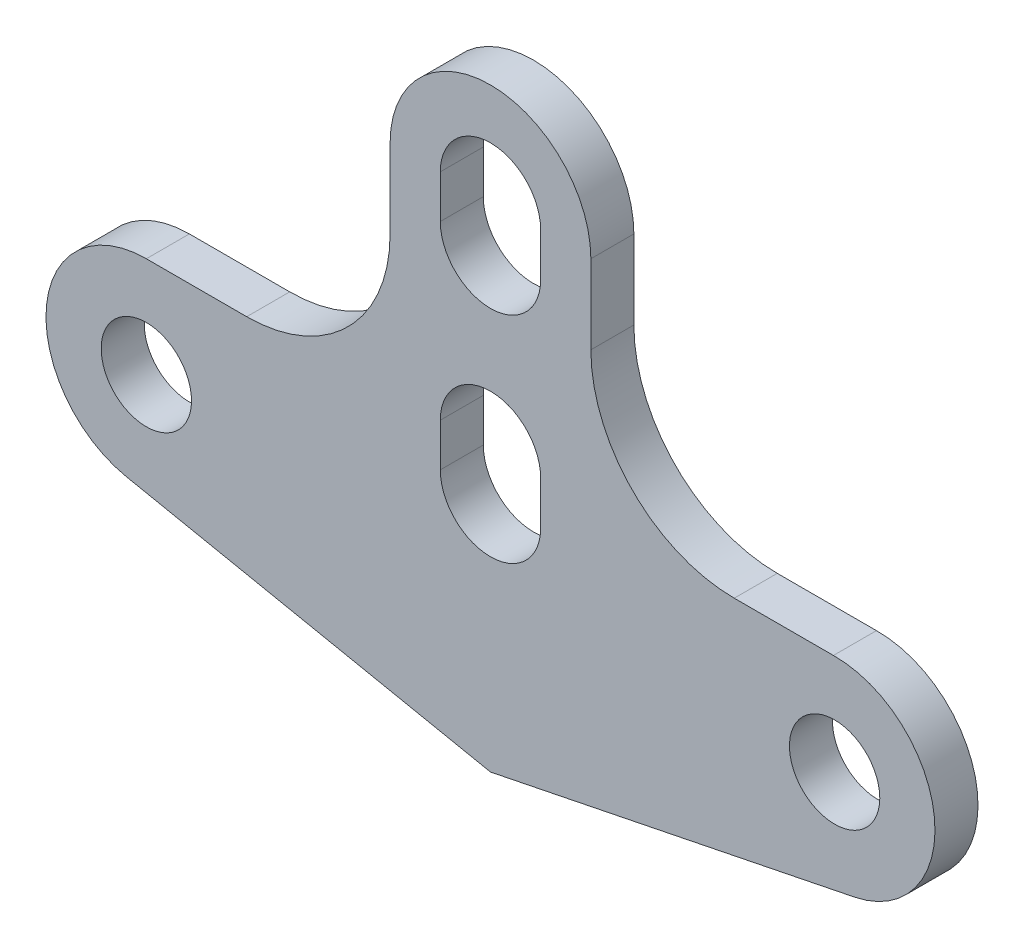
ISO-10303-21;
HEADER;
FILE_DESCRIPTION(('STEP AP214'),'2;1');
FILE_NAME('part.step','',(''),(''),'','','');
FILE_SCHEMA(('AUTOMOTIVE_DESIGN { 1 0 10303 214 1 1 1 1 }'));
ENDSEC;
DATA;
#1=APPLICATION_CONTEXT('core data for automotive mechanical design processes');
#2=APPLICATION_PROTOCOL_DEFINITION('international standard','automotive_design',2000,#1);
#3=PRODUCT_CONTEXT('',#1,'mechanical');
#4=PRODUCT('Part','Part','',(#3));
#5=PRODUCT_RELATED_PRODUCT_CATEGORY('part','',(#4));
#6=PRODUCT_DEFINITION_FORMATION('','',#4);
#7=PRODUCT_DEFINITION_CONTEXT('part definition',#1,'design');
#8=PRODUCT_DEFINITION('design','',#6,#7);
#9=PRODUCT_DEFINITION_SHAPE('','',#8);
#10=(LENGTH_UNIT() NAMED_UNIT(*) SI_UNIT(.MILLI.,.METRE.));
#11=(NAMED_UNIT(*) PLANE_ANGLE_UNIT() SI_UNIT($,.RADIAN.));
#12=(NAMED_UNIT(*) SI_UNIT($,.STERADIAN.) SOLID_ANGLE_UNIT());
#13=UNCERTAINTY_MEASURE_WITH_UNIT(LENGTH_MEASURE(1.E-05),#10,'distance_accuracy_value','');
#14=(GEOMETRIC_REPRESENTATION_CONTEXT(3) GLOBAL_UNCERTAINTY_ASSIGNED_CONTEXT((#13)) GLOBAL_UNIT_ASSIGNED_CONTEXT((#10,
#11,#12)) REPRESENTATION_CONTEXT('',''));
#15=CARTESIAN_POINT('',(0.,0.,0.));
#16=DIRECTION('',(0.,0.,1.));
#17=DIRECTION('',(1.,0.,0.));
#18=AXIS2_PLACEMENT_3D('',#15,#16,#17);
#19=CARTESIAN_POINT('',(24.,-22.5,3.));
#20=DIRECTION('',(0.,0.,1.));
#21=DIRECTION('',(1.,0.,0.));
#22=AXIS2_PLACEMENT_3D('',#19,#20,#21);
#23=PLANE('',#22);
#24=CARTESIAN_POINT('',(24.,-22.5,3.));
#25=DIRECTION('',(0.,0.,1.));
#26=DIRECTION('',(1.,0.,0.));
#27=AXIS2_PLACEMENT_3D('',#24,#25,#26);
#28=CIRCLE('',#27,3.15);
#29=CARTESIAN_POINT('',(27.15,-22.5,3.));
#30=VERTEX_POINT('',#29);
#31=EDGE_CURVE('E200',#30,#30,#28,.T.);
#32=ORIENTED_EDGE('',*,*,#31,.F.);
#33=EDGE_LOOP('',(#32));
#34=FACE_BOUND('',#33,.T.);
#35=CARTESIAN_POINT('',(0.,0.,3.));
#36=DIRECTION('',(0.,0.,1.));
#37=DIRECTION('',(-1.,0.,0.));
#38=AXIS2_PLACEMENT_3D('',#35,#36,#37);
#39=CIRCLE('',#38,3.5);
#40=CARTESIAN_POINT('',(3.5,0.,3.));
#41=VERTEX_POINT('',#40);
#42=CARTESIAN_POINT('',(-3.5,0.,3.));
#43=VERTEX_POINT('',#42);
#44=EDGE_CURVE('E225',#41,#43,#39,.T.);
#45=ORIENTED_EDGE('',*,*,#44,.F.);
#46=DIRECTION('',(0.,1.,0.));
#47=VECTOR('',#46,1.);
#48=CARTESIAN_POINT('',(3.5,0.,3.));
#49=LINE('',#48,#47);
#50=CARTESIAN_POINT('',(3.5,-3.,3.));
#51=VERTEX_POINT('',#50);
#52=EDGE_CURVE('E223',#51,#41,#49,.T.);
#53=ORIENTED_EDGE('',*,*,#52,.F.);
#54=CARTESIAN_POINT('',(0.,-3.,3.));
#55=DIRECTION('',(0.,0.,1.));
#56=DIRECTION('',(-1.,0.,0.));
#57=AXIS2_PLACEMENT_3D('',#54,#55,#56);
#58=CIRCLE('',#57,3.5);
#59=CARTESIAN_POINT('',(-3.5,-3.,3.));
#60=VERTEX_POINT('',#59);
#61=EDGE_CURVE('E221',#60,#51,#58,.T.);
#62=ORIENTED_EDGE('',*,*,#61,.F.);
#63=DIRECTION('',(0.,-1.,0.));
#64=VECTOR('',#63,1.);
#65=CARTESIAN_POINT('',(-3.5,0.,3.));
#66=LINE('',#65,#64);
#67=EDGE_CURVE('E227',#43,#60,#66,.T.);
#68=ORIENTED_EDGE('',*,*,#67,.F.);
#69=EDGE_LOOP('',(#45,#53,#62,#68));
#70=FACE_BOUND('',#69,.T.);
#71=CARTESIAN_POINT('',(24.,-22.5,3.));
#72=DIRECTION('',(0.,0.,1.));
#73=DIRECTION('',(1.,0.,0.));
#74=AXIS2_PLACEMENT_3D('',#71,#72,#73);
#75=CIRCLE('',#74,7.);
#76=CARTESIAN_POINT('',(25.388761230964,-29.3608557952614,3.));
#77=VERTEX_POINT('',#76);
#78=CARTESIAN_POINT('',(23.9169919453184,-15.500492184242,3.));
#79=VERTEX_POINT('',#78);
#80=EDGE_CURVE('E264',#77,#79,#75,.T.);
#81=ORIENTED_EDGE('',*,*,#80,.T.);
#82=DIRECTION('',(-1.,0.,0.));
#83=VECTOR('',#82,1.);
#84=CARTESIAN_POINT('',(17.,-15.500492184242,3.));
#85=LINE('',#84,#83);
#86=CARTESIAN_POINT('',(17.,-15.500492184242,3.));
#87=VERTEX_POINT('',#86);
#88=EDGE_CURVE('E267',#79,#87,#85,.T.);
#89=ORIENTED_EDGE('',*,*,#88,.T.);
#90=CARTESIAN_POINT('',(17.,-5.50049218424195,3.));
#91=DIRECTION('',(0.,0.,-1.));
#92=DIRECTION('',(1.,0.,0.));
#93=AXIS2_PLACEMENT_3D('',#90,#91,#92);
#94=CIRCLE('',#93,10.);
#95=CARTESIAN_POINT('',(7.,-5.50049218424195,3.));
#96=VERTEX_POINT('',#95);
#97=EDGE_CURVE('E269',#87,#96,#94,.T.);
#98=ORIENTED_EDGE('',*,*,#97,.T.);
#99=DIRECTION('',(0.,1.,0.));
#100=VECTOR('',#99,1.);
#101=CARTESIAN_POINT('',(7.,0.,3.));
#102=LINE('',#101,#100);
#103=CARTESIAN_POINT('',(7.,0.,3.));
#104=VERTEX_POINT('',#103);
#105=EDGE_CURVE('E271',#96,#104,#102,.T.);
#106=ORIENTED_EDGE('',*,*,#105,.T.);
#107=CARTESIAN_POINT('',(0.,0.,3.));
#108=DIRECTION('',(0.,0.,1.));
#109=DIRECTION('',(1.,0.,0.));
#110=AXIS2_PLACEMENT_3D('',#107,#108,#109);
#111=CIRCLE('',#110,7.);
#112=CARTESIAN_POINT('',(-7.,0.,3.));
#113=VERTEX_POINT('',#112);
#114=EDGE_CURVE('E273',#104,#113,#111,.T.);
#115=ORIENTED_EDGE('',*,*,#114,.T.);
#116=DIRECTION('',(0.,-1.,0.));
#117=VECTOR('',#116,1.);
#118=CARTESIAN_POINT('',(-7.,0.,3.));
#119=LINE('',#118,#117);
#120=CARTESIAN_POINT('',(-7.,-5.5,3.));
#121=VERTEX_POINT('',#120);
#122=EDGE_CURVE('E275',#113,#121,#119,.T.);
#123=ORIENTED_EDGE('',*,*,#122,.T.);
#124=CARTESIAN_POINT('',(-17.,-5.5,3.));
#125=DIRECTION('',(0.,0.,-1.));
#126=DIRECTION('',(1.,0.,0.));
#127=AXIS2_PLACEMENT_3D('',#124,#125,#126);
#128=CIRCLE('',#127,10.);
#129=CARTESIAN_POINT('',(-17.,-15.5,3.));
#130=VERTEX_POINT('',#129);
#131=EDGE_CURVE('E277',#121,#130,#128,.T.);
#132=ORIENTED_EDGE('',*,*,#131,.T.);
#133=DIRECTION('',(-1.,0.,0.));
#134=VECTOR('',#133,1.);
#135=CARTESIAN_POINT('',(-17.,-15.5,3.));
#136=LINE('',#135,#134);
#137=CARTESIAN_POINT('',(-24.,-15.5,3.));
#138=VERTEX_POINT('',#137);
#139=EDGE_CURVE('E279',#130,#138,#136,.T.);
#140=ORIENTED_EDGE('',*,*,#139,.T.);
#141=CARTESIAN_POINT('',(-24.,-22.5,3.));
#142=DIRECTION('',(0.,0.,1.));
#143=DIRECTION('',(1.,0.,0.));
#144=AXIS2_PLACEMENT_3D('',#141,#142,#143);
#145=CIRCLE('',#144,7.);
#146=CARTESIAN_POINT('',(-25.388761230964,-29.3608557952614,3.));
#147=VERTEX_POINT('',#146);
#148=EDGE_CURVE('E281',#138,#147,#145,.T.);
#149=ORIENTED_EDGE('',*,*,#148,.T.);
#150=DIRECTION('',(0.980122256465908,-0.198394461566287,0.));
#151=VECTOR('',#150,1.);
#152=CARTESIAN_POINT('',(-25.388761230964,-29.3608557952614,3.));
#153=LINE('',#152,#151);
#154=CARTESIAN_POINT('',(0.,-34.5,3.));
#155=VERTEX_POINT('',#154);
#156=EDGE_CURVE('E283',#147,#155,#153,.T.);
#157=ORIENTED_EDGE('',*,*,#156,.T.);
#158=DIRECTION('',(0.980122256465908,0.198394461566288,0.));
#159=VECTOR('',#158,1.);
#160=CARTESIAN_POINT('',(0.,-34.5,3.));
#161=LINE('',#160,#159);
#162=EDGE_CURVE('E285',#155,#77,#161,.T.);
#163=ORIENTED_EDGE('',*,*,#162,.T.);
#164=EDGE_LOOP('',(#81,#89,#98,#106,#115,#123,#132,#140,#149,#157,#163));
#165=FACE_BOUND('',#164,.T.);
#166=CARTESIAN_POINT('',(-24.,-22.5,3.));
#167=DIRECTION('',(0.,0.,1.));
#168=DIRECTION('',(1.,0.,0.));
#169=AXIS2_PLACEMENT_3D('',#166,#167,#168);
#170=CIRCLE('',#169,3.15);
#171=CARTESIAN_POINT('',(-20.85,-22.5,3.));
#172=VERTEX_POINT('',#171);
#173=EDGE_CURVE('E206',#172,#172,#170,.T.);
#174=ORIENTED_EDGE('',*,*,#173,.F.);
#175=EDGE_LOOP('',(#174));
#176=FACE_BOUND('',#175,.T.);
#177=DIRECTION('',(0.,-1.,0.));
#178=VECTOR('',#177,1.);
#179=CARTESIAN_POINT('',(-3.5,-15.,3.));
#180=LINE('',#179,#178);
#181=CARTESIAN_POINT('',(-3.5,-15.,3.));
#182=VERTEX_POINT('',#181);
#183=CARTESIAN_POINT('',(-3.5,-18.,3.));
#184=VERTEX_POINT('',#183);
#185=EDGE_CURVE('E188',#182,#184,#180,.T.);
#186=ORIENTED_EDGE('',*,*,#185,.F.);
#187=CARTESIAN_POINT('',(0.,-15.,3.));
#188=DIRECTION('',(0.,0.,1.));
#189=DIRECTION('',(-1.,0.,0.));
#190=AXIS2_PLACEMENT_3D('',#187,#188,#189);
#191=CIRCLE('',#190,3.5);
#192=CARTESIAN_POINT('',(3.5,-15.,3.));
#193=VERTEX_POINT('',#192);
#194=EDGE_CURVE('E177',#193,#182,#191,.T.);
#195=ORIENTED_EDGE('',*,*,#194,.F.);
#196=DIRECTION('',(0.,1.,0.));
#197=VECTOR('',#196,1.);
#198=CARTESIAN_POINT('',(3.5,-15.,3.));
#199=LINE('',#198,#197);
#200=CARTESIAN_POINT('',(3.5,-18.,3.));
#201=VERTEX_POINT('',#200);
#202=EDGE_CURVE('E192',#201,#193,#199,.T.);
#203=ORIENTED_EDGE('',*,*,#202,.F.);
#204=CARTESIAN_POINT('',(0.,-18.,3.));
#205=DIRECTION('',(0.,0.,1.));
#206=DIRECTION('',(1.,0.,0.));
#207=AXIS2_PLACEMENT_3D('',#204,#205,#206);
#208=CIRCLE('',#207,3.5);
#209=EDGE_CURVE('E190',#184,#201,#208,.T.);
#210=ORIENTED_EDGE('',*,*,#209,.F.);
#211=EDGE_LOOP('',(#186,#195,#203,#210));
#212=FACE_BOUND('',#211,.T.);
#213=ADVANCED_FACE('F31',(#34,#70,#165,#176,#212),#23,.T.);
#214=CARTESIAN_POINT('',(24.,-22.5,0.));
#215=DIRECTION('',(0.,0.,1.));
#216=DIRECTION('',(1.,0.,0.));
#217=AXIS2_PLACEMENT_3D('',#214,#215,#216);
#218=PLANE('',#217);
#219=CARTESIAN_POINT('',(24.,-22.5,0.));
#220=DIRECTION('',(0.,0.,1.));
#221=DIRECTION('',(1.,0.,0.));
#222=AXIS2_PLACEMENT_3D('',#219,#220,#221);
#223=CIRCLE('',#222,3.15);
#224=CARTESIAN_POINT('',(27.15,-22.5,0.));
#225=VERTEX_POINT('',#224);
#226=EDGE_CURVE('E178',#225,#225,#223,.T.);
#227=ORIENTED_EDGE('',*,*,#226,.T.);
#228=EDGE_LOOP('',(#227));
#229=FACE_BOUND('',#228,.T.);
#230=CARTESIAN_POINT('',(0.,-3.,0.));
#231=DIRECTION('',(0.,0.,1.));
#232=DIRECTION('',(-1.,0.,0.));
#233=AXIS2_PLACEMENT_3D('',#230,#231,#232);
#234=CIRCLE('',#233,3.5);
#235=CARTESIAN_POINT('',(-3.5,-3.,0.));
#236=VERTEX_POINT('',#235);
#237=CARTESIAN_POINT('',(3.5,-3.,0.));
#238=VERTEX_POINT('',#237);
#239=EDGE_CURVE('E209',#236,#238,#234,.T.);
#240=ORIENTED_EDGE('',*,*,#239,.T.);
#241=DIRECTION('',(0.,1.,0.));
#242=VECTOR('',#241,1.);
#243=CARTESIAN_POINT('',(3.5,0.,0.));
#244=LINE('',#243,#242);
#245=CARTESIAN_POINT('',(3.5,0.,0.));
#246=VERTEX_POINT('',#245);
#247=EDGE_CURVE('E212',#238,#246,#244,.T.);
#248=ORIENTED_EDGE('',*,*,#247,.T.);
#249=CARTESIAN_POINT('',(0.,0.,0.));
#250=DIRECTION('',(0.,0.,1.));
#251=DIRECTION('',(-1.,0.,0.));
#252=AXIS2_PLACEMENT_3D('',#249,#250,#251);
#253=CIRCLE('',#252,3.5);
#254=CARTESIAN_POINT('',(-3.5,0.,0.));
#255=VERTEX_POINT('',#254);
#256=EDGE_CURVE('E215',#246,#255,#253,.T.);
#257=ORIENTED_EDGE('',*,*,#256,.T.);
#258=DIRECTION('',(0.,-1.,0.));
#259=VECTOR('',#258,1.);
#260=CARTESIAN_POINT('',(-3.5,0.,0.));
#261=LINE('',#260,#259);
#262=EDGE_CURVE('E218',#255,#236,#261,.T.);
#263=ORIENTED_EDGE('',*,*,#262,.T.);
#264=EDGE_LOOP('',(#240,#248,#257,#263));
#265=FACE_BOUND('',#264,.T.);
#266=CARTESIAN_POINT('',(24.,-22.5,0.));
#267=DIRECTION('',(0.,0.,1.));
#268=DIRECTION('',(1.,0.,0.));
#269=AXIS2_PLACEMENT_3D('',#266,#267,#268);
#270=CIRCLE('',#269,7.);
#271=CARTESIAN_POINT('',(25.388761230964,-29.3608557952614,0.));
#272=VERTEX_POINT('',#271);
#273=CARTESIAN_POINT('',(23.9169919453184,-15.500492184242,0.));
#274=VERTEX_POINT('',#273);
#275=EDGE_CURVE('E240',#272,#274,#270,.T.);
#276=ORIENTED_EDGE('',*,*,#275,.F.);
#277=DIRECTION('',(0.980122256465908,0.198394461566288,0.));
#278=VECTOR('',#277,1.);
#279=CARTESIAN_POINT('',(0.,-34.5,0.));
#280=LINE('',#279,#278);
#281=CARTESIAN_POINT('',(0.,-34.5,0.));
#282=VERTEX_POINT('',#281);
#283=EDGE_CURVE('E262',#282,#272,#280,.T.);
#284=ORIENTED_EDGE('',*,*,#283,.F.);
#285=DIRECTION('',(0.980122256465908,-0.198394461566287,0.));
#286=VECTOR('',#285,1.);
#287=CARTESIAN_POINT('',(-25.388761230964,-29.3608557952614,0.));
#288=LINE('',#287,#286);
#289=CARTESIAN_POINT('',(-25.388761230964,-29.3608557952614,0.));
#290=VERTEX_POINT('',#289);
#291=EDGE_CURVE('E260',#290,#282,#288,.T.);
#292=ORIENTED_EDGE('',*,*,#291,.F.);
#293=CARTESIAN_POINT('',(-24.,-22.5,0.));
#294=DIRECTION('',(0.,0.,1.));
#295=DIRECTION('',(1.,0.,0.));
#296=AXIS2_PLACEMENT_3D('',#293,#294,#295);
#297=CIRCLE('',#296,7.);
#298=CARTESIAN_POINT('',(-24.,-15.5,0.));
#299=VERTEX_POINT('',#298);
#300=EDGE_CURVE('E258',#299,#290,#297,.T.);
#301=ORIENTED_EDGE('',*,*,#300,.F.);
#302=DIRECTION('',(-1.,0.,0.));
#303=VECTOR('',#302,1.);
#304=CARTESIAN_POINT('',(-17.,-15.5,0.));
#305=LINE('',#304,#303);
#306=CARTESIAN_POINT('',(-17.,-15.5,0.));
#307=VERTEX_POINT('',#306);
#308=EDGE_CURVE('E256',#307,#299,#305,.T.);
#309=ORIENTED_EDGE('',*,*,#308,.F.);
#310=CARTESIAN_POINT('',(-17.,-5.5,0.));
#311=DIRECTION('',(0.,0.,-1.));
#312=DIRECTION('',(1.,0.,0.));
#313=AXIS2_PLACEMENT_3D('',#310,#311,#312);
#314=CIRCLE('',#313,10.);
#315=CARTESIAN_POINT('',(-7.,-5.5,0.));
#316=VERTEX_POINT('',#315);
#317=EDGE_CURVE('E254',#316,#307,#314,.T.);
#318=ORIENTED_EDGE('',*,*,#317,.F.);
#319=DIRECTION('',(0.,-1.,0.));
#320=VECTOR('',#319,1.);
#321=CARTESIAN_POINT('',(-7.,0.,0.));
#322=LINE('',#321,#320);
#323=CARTESIAN_POINT('',(-7.,0.,0.));
#324=VERTEX_POINT('',#323);
#325=EDGE_CURVE('E252',#324,#316,#322,.T.);
#326=ORIENTED_EDGE('',*,*,#325,.F.);
#327=CARTESIAN_POINT('',(0.,0.,0.));
#328=DIRECTION('',(0.,0.,1.));
#329=DIRECTION('',(1.,0.,0.));
#330=AXIS2_PLACEMENT_3D('',#327,#328,#329);
#331=CIRCLE('',#330,7.);
#332=CARTESIAN_POINT('',(7.,0.,0.));
#333=VERTEX_POINT('',#332);
#334=EDGE_CURVE('E250',#333,#324,#331,.T.);
#335=ORIENTED_EDGE('',*,*,#334,.F.);
#336=DIRECTION('',(0.,1.,0.));
#337=VECTOR('',#336,1.);
#338=CARTESIAN_POINT('',(7.,0.,0.));
#339=LINE('',#338,#337);
#340=CARTESIAN_POINT('',(7.,-5.50049218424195,0.));
#341=VERTEX_POINT('',#340);
#342=EDGE_CURVE('E247',#341,#333,#339,.T.);
#343=ORIENTED_EDGE('',*,*,#342,.F.);
#344=CARTESIAN_POINT('',(17.,-5.50049218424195,0.));
#345=DIRECTION('',(0.,0.,-1.));
#346=DIRECTION('',(1.,0.,0.));
#347=AXIS2_PLACEMENT_3D('',#344,#345,#346);
#348=CIRCLE('',#347,10.);
#349=CARTESIAN_POINT('',(17.,-15.500492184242,0.));
#350=VERTEX_POINT('',#349);
#351=EDGE_CURVE('E245',#350,#341,#348,.T.);
#352=ORIENTED_EDGE('',*,*,#351,.F.);
#353=DIRECTION('',(-1.,0.,0.));
#354=VECTOR('',#353,1.);
#355=CARTESIAN_POINT('',(17.,-15.500492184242,0.));
#356=LINE('',#355,#354);
#357=EDGE_CURVE('E243',#274,#350,#356,.T.);
#358=ORIENTED_EDGE('',*,*,#357,.F.);
#359=EDGE_LOOP('',(#276,#284,#292,#301,#309,#318,#326,#335,#343,#352,#358));
#360=FACE_BOUND('',#359,.T.);
#361=CARTESIAN_POINT('',(-24.,-22.5,0.));
#362=DIRECTION('',(0.,0.,1.));
#363=DIRECTION('',(1.,0.,0.));
#364=AXIS2_PLACEMENT_3D('',#361,#362,#363);
#365=CIRCLE('',#364,3.15);
#366=CARTESIAN_POINT('',(-20.85,-22.5,0.));
#367=VERTEX_POINT('',#366);
#368=EDGE_CURVE('E203',#367,#367,#365,.T.);
#369=ORIENTED_EDGE('',*,*,#368,.T.);
#370=EDGE_LOOP('',(#369));
#371=FACE_BOUND('',#370,.T.);
#372=CARTESIAN_POINT('',(0.,-15.,0.));
#373=DIRECTION('',(0.,0.,1.));
#374=DIRECTION('',(-1.,0.,0.));
#375=AXIS2_PLACEMENT_3D('',#372,#373,#374);
#376=CIRCLE('',#375,3.5);
#377=CARTESIAN_POINT('',(3.5,-15.,0.));
#378=VERTEX_POINT('',#377);
#379=CARTESIAN_POINT('',(-3.5,-15.,0.));
#380=VERTEX_POINT('',#379);
#381=EDGE_CURVE('E54',#378,#380,#376,.T.);
#382=ORIENTED_EDGE('',*,*,#381,.T.);
#383=DIRECTION('',(0.,-1.,0.));
#384=VECTOR('',#383,1.);
#385=CARTESIAN_POINT('',(-3.5,-15.,0.));
#386=LINE('',#385,#384);
#387=CARTESIAN_POINT('',(-3.5,-18.,0.));
#388=VERTEX_POINT('',#387);
#389=EDGE_CURVE('E164',#380,#388,#386,.T.);
#390=ORIENTED_EDGE('',*,*,#389,.T.);
#391=CARTESIAN_POINT('',(0.,-18.,0.));
#392=DIRECTION('',(0.,0.,1.));
#393=DIRECTION('',(1.,0.,0.));
#394=AXIS2_PLACEMENT_3D('',#391,#392,#393);
#395=CIRCLE('',#394,3.5);
#396=CARTESIAN_POINT('',(3.5,-18.,0.));
#397=VERTEX_POINT('',#396);
#398=EDGE_CURVE('E173',#388,#397,#395,.T.);
#399=ORIENTED_EDGE('',*,*,#398,.T.);
#400=DIRECTION('',(0.,1.,0.));
#401=VECTOR('',#400,1.);
#402=CARTESIAN_POINT('',(3.5,-15.,0.));
#403=LINE('',#402,#401);
#404=EDGE_CURVE('E182',#397,#378,#403,.T.);
#405=ORIENTED_EDGE('',*,*,#404,.T.);
#406=EDGE_LOOP('',(#382,#390,#399,#405));
#407=FACE_BOUND('',#406,.T.);
#408=ADVANCED_FACE('F181',(#229,#265,#360,#371,#407),#218,.F.);
#409=CARTESIAN_POINT('',(24.,-22.5,3.));
#410=DIRECTION('',(0.,0.,-1.));
#411=DIRECTION('',(-1.,0.,0.));
#412=AXIS2_PLACEMENT_3D('',#409,#410,#411);
#413=CYLINDRICAL_SURFACE('',#412,7.);
#414=ORIENTED_EDGE('',*,*,#275,.T.);
#415=DIRECTION('',(0.,0.,-1.));
#416=VECTOR('',#415,1.);
#417=CARTESIAN_POINT('',(23.9169919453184,-15.500492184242,3.));
#418=LINE('',#417,#416);
#419=EDGE_CURVE('E11',#79,#274,#418,.T.);
#420=ORIENTED_EDGE('',*,*,#419,.F.);
#421=ORIENTED_EDGE('',*,*,#80,.F.);
#422=DIRECTION('',(0.,0.,-1.));
#423=VECTOR('',#422,1.);
#424=CARTESIAN_POINT('',(25.388761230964,-29.3608557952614,3.));
#425=LINE('',#424,#423);
#426=EDGE_CURVE('E287',#77,#272,#425,.T.);
#427=ORIENTED_EDGE('',*,*,#426,.T.);
#428=EDGE_LOOP('',(#414,#420,#421,#427));
#429=FACE_BOUND('',#428,.T.);
#430=ADVANCED_FACE('F33',(#429),#413,.T.);
#431=CARTESIAN_POINT('',(17.,-15.500492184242,3.));
#432=DIRECTION('',(0.,-1.,0.));
#433=DIRECTION('',(0.,0.,-1.));
#434=AXIS2_PLACEMENT_3D('',#431,#432,#433);
#435=PLANE('',#434);
#436=ORIENTED_EDGE('',*,*,#357,.T.);
#437=DIRECTION('',(0.,0.,-1.));
#438=VECTOR('',#437,1.);
#439=CARTESIAN_POINT('',(17.,-15.500492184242,3.));
#440=LINE('',#439,#438);
#441=EDGE_CURVE('E39',#87,#350,#440,.T.);
#442=ORIENTED_EDGE('',*,*,#441,.F.);
#443=ORIENTED_EDGE('',*,*,#88,.F.);
#444=ORIENTED_EDGE('',*,*,#419,.T.);
#445=EDGE_LOOP('',(#436,#442,#443,#444));
#446=FACE_BOUND('',#445,.T.);
#447=ADVANCED_FACE('F340',(#446),#435,.F.);
#448=CARTESIAN_POINT('',(17.,-5.50049218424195,3.));
#449=DIRECTION('',(0.,0.,-1.));
#450=DIRECTION('',(-1.,0.,0.));
#451=AXIS2_PLACEMENT_3D('',#448,#449,#450);
#452=CYLINDRICAL_SURFACE('',#451,10.);
#453=ORIENTED_EDGE('',*,*,#351,.T.);
#454=DIRECTION('',(0.,0.,-1.));
#455=VECTOR('',#454,1.);
#456=CARTESIAN_POINT('',(7.,-5.50049218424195,3.));
#457=LINE('',#456,#455);
#458=EDGE_CURVE('E311',#96,#341,#457,.T.);
#459=ORIENTED_EDGE('',*,*,#458,.F.);
#460=ORIENTED_EDGE('',*,*,#97,.F.);
#461=ORIENTED_EDGE('',*,*,#441,.T.);
#462=EDGE_LOOP('',(#453,#459,#460,#461));
#463=FACE_BOUND('',#462,.T.);
#464=ADVANCED_FACE('F318',(#463),#452,.F.);
#465=CARTESIAN_POINT('',(7.,0.,3.));
#466=DIRECTION('',(-1.,0.,0.));
#467=DIRECTION('',(0.,0.,1.));
#468=AXIS2_PLACEMENT_3D('',#465,#466,#467);
#469=PLANE('',#468);
#470=ORIENTED_EDGE('',*,*,#342,.T.);
#471=DIRECTION('',(0.,0.,-1.));
#472=VECTOR('',#471,1.);
#473=CARTESIAN_POINT('',(7.,0.,3.));
#474=LINE('',#473,#472);
#475=EDGE_CURVE('E308',#104,#333,#474,.T.);
#476=ORIENTED_EDGE('',*,*,#475,.F.);
#477=ORIENTED_EDGE('',*,*,#105,.F.);
#478=ORIENTED_EDGE('',*,*,#458,.T.);
#479=EDGE_LOOP('',(#470,#476,#477,#478));
#480=FACE_BOUND('',#479,.T.);
#481=ADVANCED_FACE('F328',(#480),#469,.F.);
#482=CARTESIAN_POINT('',(0.,0.,3.));
#483=DIRECTION('',(0.,0.,-1.));
#484=DIRECTION('',(-1.,0.,0.));
#485=AXIS2_PLACEMENT_3D('',#482,#483,#484);
#486=CYLINDRICAL_SURFACE('',#485,7.);
#487=ORIENTED_EDGE('',*,*,#334,.T.);
#488=DIRECTION('',(0.,0.,-1.));
#489=VECTOR('',#488,1.);
#490=CARTESIAN_POINT('',(-7.,0.,3.));
#491=LINE('',#490,#489);
#492=EDGE_CURVE('E305',#113,#324,#491,.T.);
#493=ORIENTED_EDGE('',*,*,#492,.F.);
#494=ORIENTED_EDGE('',*,*,#114,.F.);
#495=ORIENTED_EDGE('',*,*,#475,.T.);
#496=EDGE_LOOP('',(#487,#493,#494,#495));
#497=FACE_BOUND('',#496,.T.);
#498=ADVANCED_FACE('F332',(#497),#486,.T.);
#499=CARTESIAN_POINT('',(-7.,0.,3.));
#500=DIRECTION('',(1.,0.,0.));
#501=DIRECTION('',(0.,0.,-1.));
#502=AXIS2_PLACEMENT_3D('',#499,#500,#501);
#503=PLANE('',#502);
#504=ORIENTED_EDGE('',*,*,#325,.T.);
#505=DIRECTION('',(0.,0.,-1.));
#506=VECTOR('',#505,1.);
#507=CARTESIAN_POINT('',(-7.,-5.5,3.));
#508=LINE('',#507,#506);
#509=EDGE_CURVE('E302',#121,#316,#508,.T.);
#510=ORIENTED_EDGE('',*,*,#509,.F.);
#511=ORIENTED_EDGE('',*,*,#122,.F.);
#512=ORIENTED_EDGE('',*,*,#492,.T.);
#513=EDGE_LOOP('',(#504,#510,#511,#512));
#514=FACE_BOUND('',#513,.T.);
#515=ADVANCED_FACE('F368',(#514),#503,.F.);
#516=CARTESIAN_POINT('',(-17.,-5.5,3.));
#517=DIRECTION('',(0.,0.,-1.));
#518=DIRECTION('',(-1.,0.,0.));
#519=AXIS2_PLACEMENT_3D('',#516,#517,#518);
#520=CYLINDRICAL_SURFACE('',#519,10.);
#521=ORIENTED_EDGE('',*,*,#317,.T.);
#522=DIRECTION('',(0.,0.,-1.));
#523=VECTOR('',#522,1.);
#524=CARTESIAN_POINT('',(-17.,-15.5,3.));
#525=LINE('',#524,#523);
#526=EDGE_CURVE('E299',#130,#307,#525,.T.);
#527=ORIENTED_EDGE('',*,*,#526,.F.);
#528=ORIENTED_EDGE('',*,*,#131,.F.);
#529=ORIENTED_EDGE('',*,*,#509,.T.);
#530=EDGE_LOOP('',(#521,#527,#528,#529));
#531=FACE_BOUND('',#530,.T.);
#532=ADVANCED_FACE('F366',(#531),#520,.F.);
#533=CARTESIAN_POINT('',(-17.,-15.5,3.));
#534=DIRECTION('',(0.,-1.,0.));
#535=DIRECTION('',(0.,0.,-1.));
#536=AXIS2_PLACEMENT_3D('',#533,#534,#535);
#537=PLANE('',#536);
#538=ORIENTED_EDGE('',*,*,#308,.T.);
#539=DIRECTION('',(0.,0.,-1.));
#540=VECTOR('',#539,1.);
#541=CARTESIAN_POINT('',(-24.,-15.5,3.));
#542=LINE('',#541,#540);
#543=EDGE_CURVE('E296',#138,#299,#542,.T.);
#544=ORIENTED_EDGE('',*,*,#543,.F.);
#545=ORIENTED_EDGE('',*,*,#139,.F.);
#546=ORIENTED_EDGE('',*,*,#526,.T.);
#547=EDGE_LOOP('',(#538,#544,#545,#546));
#548=FACE_BOUND('',#547,.T.);
#549=ADVANCED_FACE('F361',(#548),#537,.F.);
#550=CARTESIAN_POINT('',(-24.,-22.5,3.));
#551=DIRECTION('',(0.,0.,-1.));
#552=DIRECTION('',(-1.,0.,0.));
#553=AXIS2_PLACEMENT_3D('',#550,#551,#552);
#554=CYLINDRICAL_SURFACE('',#553,7.);
#555=ORIENTED_EDGE('',*,*,#300,.T.);
#556=DIRECTION('',(0.,0.,-1.));
#557=VECTOR('',#556,1.);
#558=CARTESIAN_POINT('',(-25.388761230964,-29.3608557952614,3.));
#559=LINE('',#558,#557);
#560=EDGE_CURVE('E293',#147,#290,#559,.T.);
#561=ORIENTED_EDGE('',*,*,#560,.F.);
#562=ORIENTED_EDGE('',*,*,#148,.F.);
#563=ORIENTED_EDGE('',*,*,#543,.T.);
#564=EDGE_LOOP('',(#555,#561,#562,#563));
#565=FACE_BOUND('',#564,.T.);
#566=ADVANCED_FACE('F356',(#565),#554,.T.);
#567=CARTESIAN_POINT('',(-25.388761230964,-29.3608557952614,3.));
#568=DIRECTION('',(0.198394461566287,0.980122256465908,0.));
#569=DIRECTION('',(-0.980122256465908,0.198394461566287,0.));
#570=AXIS2_PLACEMENT_3D('',#567,#568,#569);
#571=PLANE('',#570);
#572=ORIENTED_EDGE('',*,*,#291,.T.);
#573=DIRECTION('',(0.,0.,-1.));
#574=VECTOR('',#573,1.);
#575=CARTESIAN_POINT('',(0.,-34.5,3.));
#576=LINE('',#575,#574);
#577=EDGE_CURVE('E290',#155,#282,#576,.T.);
#578=ORIENTED_EDGE('',*,*,#577,.F.);
#579=ORIENTED_EDGE('',*,*,#156,.F.);
#580=ORIENTED_EDGE('',*,*,#560,.T.);
#581=EDGE_LOOP('',(#572,#578,#579,#580));
#582=FACE_BOUND('',#581,.T.);
#583=ADVANCED_FACE('F352',(#582),#571,.F.);
#584=CARTESIAN_POINT('',(0.,-34.5,3.));
#585=DIRECTION('',(-0.198394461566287,0.980122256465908,0.));
#586=DIRECTION('',(-0.980122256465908,-0.198394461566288,0.));
#587=AXIS2_PLACEMENT_3D('',#584,#585,#586);
#588=PLANE('',#587);
#589=ORIENTED_EDGE('',*,*,#283,.T.);
#590=ORIENTED_EDGE('',*,*,#426,.F.);
#591=ORIENTED_EDGE('',*,*,#162,.F.);
#592=ORIENTED_EDGE('',*,*,#577,.T.);
#593=EDGE_LOOP('',(#589,#590,#591,#592));
#594=FACE_BOUND('',#593,.T.);
#595=ADVANCED_FACE('F347',(#594),#588,.F.);
#596=CARTESIAN_POINT('',(0.,-3.,3.));
#597=DIRECTION('',(0.,0.,-1.));
#598=DIRECTION('',(-1.,0.,0.));
#599=AXIS2_PLACEMENT_3D('',#596,#597,#598);
#600=CYLINDRICAL_SURFACE('',#599,3.5);
#601=ORIENTED_EDGE('',*,*,#239,.F.);
#602=DIRECTION('',(0.,0.,-1.));
#603=VECTOR('',#602,1.);
#604=CARTESIAN_POINT('',(-3.5,-3.,3.));
#605=LINE('',#604,#603);
#606=EDGE_CURVE('E230',#60,#236,#605,.T.);
#607=ORIENTED_EDGE('',*,*,#606,.F.);
#608=ORIENTED_EDGE('',*,*,#61,.T.);
#609=DIRECTION('',(0.,0.,-1.));
#610=VECTOR('',#609,1.);
#611=CARTESIAN_POINT('',(3.5,-3.,3.));
#612=LINE('',#611,#610);
#613=EDGE_CURVE('E237',#51,#238,#612,.T.);
#614=ORIENTED_EDGE('',*,*,#613,.T.);
#615=EDGE_LOOP('',(#601,#607,#608,#614));
#616=FACE_BOUND('',#615,.T.);
#617=ADVANCED_FACE('F391',(#616),#600,.F.);
#618=CARTESIAN_POINT('',(3.5,0.,3.));
#619=DIRECTION('',(-1.,0.,0.));
#620=DIRECTION('',(0.,0.,1.));
#621=AXIS2_PLACEMENT_3D('',#618,#619,#620);
#622=PLANE('',#621);
#623=ORIENTED_EDGE('',*,*,#247,.F.);
#624=ORIENTED_EDGE('',*,*,#613,.F.);
#625=ORIENTED_EDGE('',*,*,#52,.T.);
#626=DIRECTION('',(0.,0.,-1.));
#627=VECTOR('',#626,1.);
#628=CARTESIAN_POINT('',(3.5,0.,3.));
#629=LINE('',#628,#627);
#630=EDGE_CURVE('E235',#41,#246,#629,.T.);
#631=ORIENTED_EDGE('',*,*,#630,.T.);
#632=EDGE_LOOP('',(#623,#624,#625,#631));
#633=FACE_BOUND('',#632,.T.);
#634=ADVANCED_FACE('F419',(#633),#622,.T.);
#635=CARTESIAN_POINT('',(0.,0.,3.));
#636=DIRECTION('',(0.,0.,-1.));
#637=DIRECTION('',(-1.,0.,0.));
#638=AXIS2_PLACEMENT_3D('',#635,#636,#637);
#639=CYLINDRICAL_SURFACE('',#638,3.5);
#640=ORIENTED_EDGE('',*,*,#256,.F.);
#641=ORIENTED_EDGE('',*,*,#630,.F.);
#642=ORIENTED_EDGE('',*,*,#44,.T.);
#643=DIRECTION('',(0.,0.,-1.));
#644=VECTOR('',#643,1.);
#645=CARTESIAN_POINT('',(-3.5,0.,3.));
#646=LINE('',#645,#644);
#647=EDGE_CURVE('E233',#43,#255,#646,.T.);
#648=ORIENTED_EDGE('',*,*,#647,.T.);
#649=EDGE_LOOP('',(#640,#641,#642,#648));
#650=FACE_BOUND('',#649,.T.);
#651=ADVANCED_FACE('F426',(#650),#639,.F.);
#652=CARTESIAN_POINT('',(-3.5,0.,3.));
#653=DIRECTION('',(1.,0.,0.));
#654=DIRECTION('',(0.,0.,-1.));
#655=AXIS2_PLACEMENT_3D('',#652,#653,#654);
#656=PLANE('',#655);
#657=ORIENTED_EDGE('',*,*,#262,.F.);
#658=ORIENTED_EDGE('',*,*,#647,.F.);
#659=ORIENTED_EDGE('',*,*,#67,.T.);
#660=ORIENTED_EDGE('',*,*,#606,.T.);
#661=EDGE_LOOP('',(#657,#658,#659,#660));
#662=FACE_BOUND('',#661,.T.);
#663=ADVANCED_FACE('F434',(#662),#656,.T.);
#664=CARTESIAN_POINT('',(-24.,-22.5,3.));
#665=DIRECTION('',(0.,0.,-1.));
#666=DIRECTION('',(-1.,0.,0.));
#667=AXIS2_PLACEMENT_3D('',#664,#665,#666);
#668=CYLINDRICAL_SURFACE('',#667,3.15);
#669=ORIENTED_EDGE('',*,*,#173,.T.);
#670=EDGE_LOOP('',(#669));
#671=FACE_BOUND('',#670,.T.);
#672=ORIENTED_EDGE('',*,*,#368,.F.);
#673=EDGE_LOOP('',(#672));
#674=FACE_BOUND('',#673,.T.);
#675=ADVANCED_FACE('F442',(#671,#674),#668,.F.);
#676=CARTESIAN_POINT('',(24.,-22.5,3.));
#677=DIRECTION('',(0.,0.,-1.));
#678=DIRECTION('',(-1.,0.,0.));
#679=AXIS2_PLACEMENT_3D('',#676,#677,#678);
#680=CYLINDRICAL_SURFACE('',#679,3.15);
#681=ORIENTED_EDGE('',*,*,#31,.T.);
#682=EDGE_LOOP('',(#681));
#683=FACE_BOUND('',#682,.T.);
#684=ORIENTED_EDGE('',*,*,#226,.F.);
#685=EDGE_LOOP('',(#684));
#686=FACE_BOUND('',#685,.T.);
#687=ADVANCED_FACE('F450',(#683,#686),#680,.F.);
#688=CARTESIAN_POINT('',(0.,-15.,3.));
#689=DIRECTION('',(0.,0.,-1.));
#690=DIRECTION('',(-1.,0.,0.));
#691=AXIS2_PLACEMENT_3D('',#688,#689,#690);
#692=CYLINDRICAL_SURFACE('',#691,3.5);
#693=ORIENTED_EDGE('',*,*,#381,.F.);
#694=DIRECTION('',(0.,0.,-1.));
#695=VECTOR('',#694,1.);
#696=CARTESIAN_POINT('',(3.5,-15.,3.));
#697=LINE('',#696,#695);
#698=EDGE_CURVE('E194',#193,#378,#697,.T.);
#699=ORIENTED_EDGE('',*,*,#698,.F.);
#700=ORIENTED_EDGE('',*,*,#194,.T.);
#701=DIRECTION('',(0.,0.,-1.));
#702=VECTOR('',#701,1.);
#703=CARTESIAN_POINT('',(-3.5,-15.,3.));
#704=LINE('',#703,#702);
#705=EDGE_CURVE('E166',#182,#380,#704,.T.);
#706=ORIENTED_EDGE('',*,*,#705,.T.);
#707=EDGE_LOOP('',(#693,#699,#700,#706));
#708=FACE_BOUND('',#707,.T.);
#709=ADVANCED_FACE('F175',(#708),#692,.F.);
#710=CARTESIAN_POINT('',(-3.5,-15.,3.));
#711=DIRECTION('',(1.,0.,0.));
#712=DIRECTION('',(0.,0.,-1.));
#713=AXIS2_PLACEMENT_3D('',#710,#711,#712);
#714=PLANE('',#713);
#715=ORIENTED_EDGE('',*,*,#389,.F.);
#716=ORIENTED_EDGE('',*,*,#705,.F.);
#717=ORIENTED_EDGE('',*,*,#185,.T.);
#718=DIRECTION('',(0.,0.,-1.));
#719=VECTOR('',#718,1.);
#720=CARTESIAN_POINT('',(-3.5,-18.,3.));
#721=LINE('',#720,#719);
#722=EDGE_CURVE('E169',#184,#388,#721,.T.);
#723=ORIENTED_EDGE('',*,*,#722,.T.);
#724=EDGE_LOOP('',(#715,#716,#717,#723));
#725=FACE_BOUND('',#724,.T.);
#726=ADVANCED_FACE('F165',(#725),#714,.T.);
#727=CARTESIAN_POINT('',(0.,-18.,3.));
#728=DIRECTION('',(0.,0.,-1.));
#729=DIRECTION('',(-1.,0.,0.));
#730=AXIS2_PLACEMENT_3D('',#727,#728,#729);
#731=CYLINDRICAL_SURFACE('',#730,3.5);
#732=ORIENTED_EDGE('',*,*,#398,.F.);
#733=ORIENTED_EDGE('',*,*,#722,.F.);
#734=ORIENTED_EDGE('',*,*,#209,.T.);
#735=DIRECTION('',(0.,0.,-1.));
#736=VECTOR('',#735,1.);
#737=CARTESIAN_POINT('',(3.5,-18.,3.));
#738=LINE('',#737,#736);
#739=EDGE_CURVE('E46',#201,#397,#738,.T.);
#740=ORIENTED_EDGE('',*,*,#739,.T.);
#741=EDGE_LOOP('',(#732,#733,#734,#740));
#742=FACE_BOUND('',#741,.T.);
#743=ADVANCED_FACE('F471',(#742),#731,.F.);
#744=CARTESIAN_POINT('',(3.5,-15.,3.));
#745=DIRECTION('',(-1.,0.,0.));
#746=DIRECTION('',(0.,-1.,0.));
#747=AXIS2_PLACEMENT_3D('',#744,#745,#746);
#748=PLANE('',#747);
#749=ORIENTED_EDGE('',*,*,#404,.F.);
#750=ORIENTED_EDGE('',*,*,#739,.F.);
#751=ORIENTED_EDGE('',*,*,#202,.T.);
#752=ORIENTED_EDGE('',*,*,#698,.T.);
#753=EDGE_LOOP('',(#749,#750,#751,#752));
#754=FACE_BOUND('',#753,.T.);
#755=ADVANCED_FACE('F478',(#754),#748,.T.);
#756=CLOSED_SHELL('',(#213,#408,#430,#447,#464,#481,#498,#515,#532,#549,#566,#583,#595,#617,
#634,#651,#663,#675,#687,#709,#726,#743,#755));
#757=MANIFOLD_SOLID_BREP('B2',#756);
#758=ADVANCED_BREP_SHAPE_REPRESENTATION('',(#18,#757),#14);
#759=SHAPE_DEFINITION_REPRESENTATION(#9,#758);
ENDSEC;
END-ISO-10303-21;
